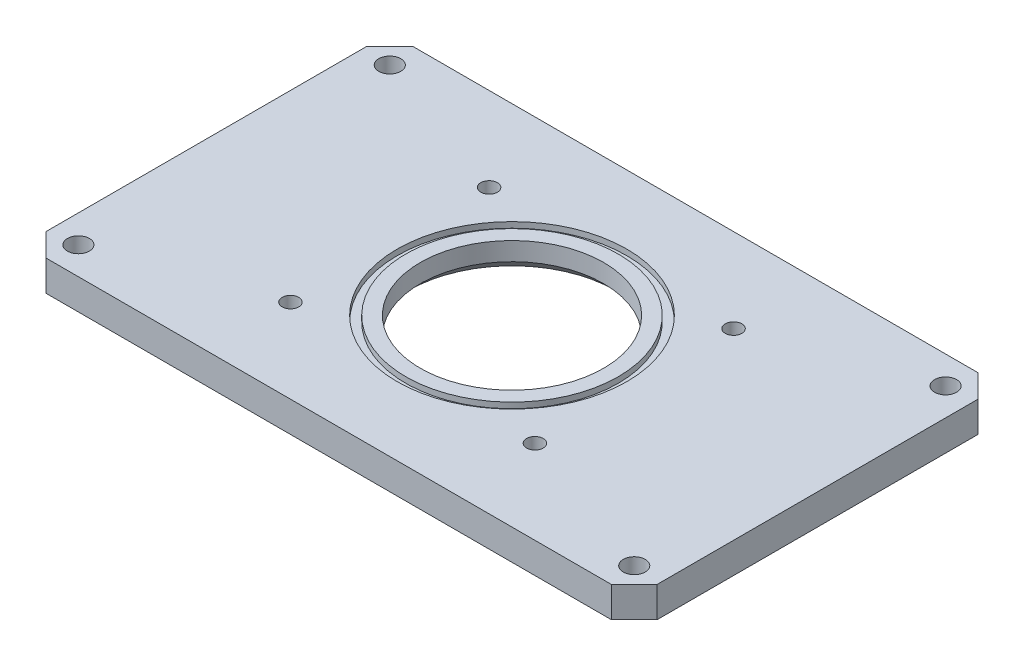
ISO-10303-21;
HEADER;
FILE_DESCRIPTION(('STEP AP214'),'2;1');
FILE_NAME('part.step','',(''),(''),'','','');
FILE_SCHEMA(('AUTOMOTIVE_DESIGN { 1 0 10303 214 1 1 1 1 }'));
ENDSEC;
DATA;
#1=APPLICATION_CONTEXT('core data for automotive mechanical design processes');
#2=APPLICATION_PROTOCOL_DEFINITION('international standard','automotive_design',2000,#1);
#3=PRODUCT_CONTEXT('',#1,'mechanical');
#4=PRODUCT('Part','Part','',(#3));
#5=PRODUCT_RELATED_PRODUCT_CATEGORY('part','',(#4));
#6=PRODUCT_DEFINITION_FORMATION('','',#4);
#7=PRODUCT_DEFINITION_CONTEXT('part definition',#1,'design');
#8=PRODUCT_DEFINITION('design','',#6,#7);
#9=PRODUCT_DEFINITION_SHAPE('','',#8);
#10=(LENGTH_UNIT() NAMED_UNIT(*) SI_UNIT(.MILLI.,.METRE.));
#11=(NAMED_UNIT(*) PLANE_ANGLE_UNIT() SI_UNIT($,.RADIAN.));
#12=(NAMED_UNIT(*) SI_UNIT($,.STERADIAN.) SOLID_ANGLE_UNIT());
#13=UNCERTAINTY_MEASURE_WITH_UNIT(LENGTH_MEASURE(1.E-05),#10,'distance_accuracy_value','');
#14=(GEOMETRIC_REPRESENTATION_CONTEXT(3) GLOBAL_UNCERTAINTY_ASSIGNED_CONTEXT((#13)) GLOBAL_UNIT_ASSIGNED_CONTEXT((#10,
#11,#12)) REPRESENTATION_CONTEXT('',''));
#15=CARTESIAN_POINT('',(0.,0.,0.));
#16=DIRECTION('',(0.,0.,1.));
#17=DIRECTION('',(1.,0.,0.));
#18=AXIS2_PLACEMENT_3D('',#15,#16,#17);
#19=CARTESIAN_POINT('',(0.,3.175,0.));
#20=DIRECTION('',(0.,-1.,0.));
#21=DIRECTION('',(0.,0.,-1.));
#22=AXIS2_PLACEMENT_3D('',#19,#20,#21);
#23=PLANE('',#22);
#24=CARTESIAN_POINT('',(0.,3.17500000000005,0.));
#25=DIRECTION('',(0.,-1.,0.));
#26=DIRECTION('',(1.,0.,0.));
#27=AXIS2_PLACEMENT_3D('',#24,#25,#26);
#28=CIRCLE('',#27,22.0853);
#29=CARTESIAN_POINT('',(22.0853,3.175,0.));
#30=VERTEX_POINT('',#29);
#31=EDGE_CURVE('E129',#30,#30,#28,.T.);
#32=ORIENTED_EDGE('',*,*,#31,.F.);
#33=EDGE_LOOP('',(#32));
#34=FACE_BOUND('',#33,.T.);
#35=CARTESIAN_POINT('',(0.,3.175,0.));
#36=DIRECTION('',(0.,-1.,0.));
#37=DIRECTION('',(0.,0.,-1.));
#38=AXIS2_PLACEMENT_3D('',#35,#36,#37);
#39=CIRCLE('',#38,19.05);
#40=CARTESIAN_POINT('',(0.,3.175,-19.05));
#41=VERTEX_POINT('',#40);
#42=EDGE_CURVE('E147',#41,#41,#39,.T.);
#43=ORIENTED_EDGE('',*,*,#42,.T.);
#44=EDGE_LOOP('',(#43));
#45=FACE_BOUND('',#44,.T.);
#46=ADVANCED_FACE('F34',(#34,#45),#23,.F.);
#47=CARTESIAN_POINT('',(63.5,3.175,38.1));
#48=DIRECTION('',(-1.,0.,0.));
#49=DIRECTION('',(0.,0.,1.));
#50=AXIS2_PLACEMENT_3D('',#47,#48,#49);
#51=PLANE('',#50);
#52=DIRECTION('',(0.,0.,-1.));
#53=VECTOR('',#52,1.);
#54=CARTESIAN_POINT('',(63.5,-3.175,38.1));
#55=LINE('',#54,#53);
#56=CARTESIAN_POINT('',(63.5,-3.175,33.3375));
#57=VERTEX_POINT('',#56);
#58=CARTESIAN_POINT('',(63.5,-3.175,-33.3375));
#59=VERTEX_POINT('',#58);
#60=EDGE_CURVE('E174',#57,#59,#55,.T.);
#61=ORIENTED_EDGE('',*,*,#60,.T.);
#62=DIRECTION('',(0.,1.,0.));
#63=VECTOR('',#62,1.);
#64=CARTESIAN_POINT('',(63.5,3.175,-33.3375));
#65=LINE('',#64,#63);
#66=CARTESIAN_POINT('',(63.5,3.175,-33.3375));
#67=VERTEX_POINT('',#66);
#68=EDGE_CURVE('E223',#59,#67,#65,.T.);
#69=ORIENTED_EDGE('',*,*,#68,.T.);
#70=DIRECTION('',(0.,0.,-1.));
#71=VECTOR('',#70,1.);
#72=CARTESIAN_POINT('',(63.5,3.175,38.1));
#73=LINE('',#72,#71);
#74=CARTESIAN_POINT('',(63.5,3.175,33.3375));
#75=VERTEX_POINT('',#74);
#76=EDGE_CURVE('E175',#75,#67,#73,.T.);
#77=ORIENTED_EDGE('',*,*,#76,.F.);
#78=DIRECTION('',(0.,-1.,0.));
#79=VECTOR('',#78,1.);
#80=CARTESIAN_POINT('',(63.5,3.175,33.3375));
#81=LINE('',#80,#79);
#82=EDGE_CURVE('E220',#75,#57,#81,.T.);
#83=ORIENTED_EDGE('',*,*,#82,.T.);
#84=EDGE_LOOP('',(#61,#69,#77,#83));
#85=FACE_BOUND('',#84,.T.);
#86=ADVANCED_FACE('F248',(#85),#51,.F.);
#87=CARTESIAN_POINT('',(-63.5,3.175,-38.1));
#88=DIRECTION('',(0.,0.,1.));
#89=DIRECTION('',(1.,0.,0.));
#90=AXIS2_PLACEMENT_3D('',#87,#88,#89);
#91=PLANE('',#90);
#92=DIRECTION('',(-1.,0.,0.));
#93=VECTOR('',#92,1.);
#94=CARTESIAN_POINT('',(-63.5,-3.175,-38.1));
#95=LINE('',#94,#93);
#96=CARTESIAN_POINT('',(58.7375,-3.175,-38.1));
#97=VERTEX_POINT('',#96);
#98=CARTESIAN_POINT('',(-58.7375,-3.175,-38.1));
#99=VERTEX_POINT('',#98);
#100=EDGE_CURVE('E189',#97,#99,#95,.T.);
#101=ORIENTED_EDGE('',*,*,#100,.T.);
#102=DIRECTION('',(0.,1.,0.));
#103=VECTOR('',#102,1.);
#104=CARTESIAN_POINT('',(-58.7375,3.175,-38.1));
#105=LINE('',#104,#103);
#106=CARTESIAN_POINT('',(-58.7375,3.175,-38.1));
#107=VERTEX_POINT('',#106);
#108=EDGE_CURVE('E211',#99,#107,#105,.T.);
#109=ORIENTED_EDGE('',*,*,#108,.T.);
#110=DIRECTION('',(-1.,0.,0.));
#111=VECTOR('',#110,1.);
#112=CARTESIAN_POINT('',(-63.5,3.175,-38.1));
#113=LINE('',#112,#111);
#114=CARTESIAN_POINT('',(58.7375,3.175,-38.1));
#115=VERTEX_POINT('',#114);
#116=EDGE_CURVE('E178',#115,#107,#113,.T.);
#117=ORIENTED_EDGE('',*,*,#116,.F.);
#118=DIRECTION('',(0.,-1.,0.));
#119=VECTOR('',#118,1.);
#120=CARTESIAN_POINT('',(58.7375,3.175,-38.1));
#121=LINE('',#120,#119);
#122=EDGE_CURVE('E208',#115,#97,#121,.T.);
#123=ORIENTED_EDGE('',*,*,#122,.T.);
#124=EDGE_LOOP('',(#101,#109,#117,#123));
#125=FACE_BOUND('',#124,.T.);
#126=ADVANCED_FACE('F255',(#125),#91,.F.);
#127=CARTESIAN_POINT('',(-63.5,3.175,38.1));
#128=DIRECTION('',(1.,0.,0.));
#129=DIRECTION('',(0.,0.,-1.));
#130=AXIS2_PLACEMENT_3D('',#127,#128,#129);
#131=PLANE('',#130);
#132=DIRECTION('',(0.,0.,1.));
#133=VECTOR('',#132,1.);
#134=CARTESIAN_POINT('',(-63.5,3.175,38.1));
#135=LINE('',#134,#133);
#136=CARTESIAN_POINT('',(-63.5,3.175,-33.3375));
#137=VERTEX_POINT('',#136);
#138=CARTESIAN_POINT('',(-63.5,3.175,33.3375));
#139=VERTEX_POINT('',#138);
#140=EDGE_CURVE('E182',#137,#139,#135,.T.);
#141=ORIENTED_EDGE('',*,*,#140,.F.);
#142=DIRECTION('',(0.,-1.,0.));
#143=VECTOR('',#142,1.);
#144=CARTESIAN_POINT('',(-63.5,3.175,-33.3375));
#145=LINE('',#144,#143);
#146=CARTESIAN_POINT('',(-63.5,-3.175,-33.3375));
#147=VERTEX_POINT('',#146);
#148=EDGE_CURVE('E197',#137,#147,#145,.T.);
#149=ORIENTED_EDGE('',*,*,#148,.T.);
#150=DIRECTION('',(0.,0.,1.));
#151=VECTOR('',#150,1.);
#152=CARTESIAN_POINT('',(-63.5,-3.175,38.1));
#153=LINE('',#152,#151);
#154=CARTESIAN_POINT('',(-63.5,-3.175,33.3375));
#155=VERTEX_POINT('',#154);
#156=EDGE_CURVE('E192',#147,#155,#153,.T.);
#157=ORIENTED_EDGE('',*,*,#156,.T.);
#158=DIRECTION('',(0.,1.,0.));
#159=VECTOR('',#158,1.);
#160=CARTESIAN_POINT('',(-63.5,3.175,33.3375));
#161=LINE('',#160,#159);
#162=EDGE_CURVE('E186',#155,#139,#161,.T.);
#163=ORIENTED_EDGE('',*,*,#162,.T.);
#164=EDGE_LOOP('',(#141,#149,#157,#163));
#165=FACE_BOUND('',#164,.T.);
#166=ADVANCED_FACE('F272',(#165),#131,.F.);
#167=CARTESIAN_POINT('',(-63.5,3.175,38.1));
#168=DIRECTION('',(0.,0.,-1.));
#169=DIRECTION('',(-1.,0.,0.));
#170=AXIS2_PLACEMENT_3D('',#167,#168,#169);
#171=PLANE('',#170);
#172=DIRECTION('',(1.,0.,0.));
#173=VECTOR('',#172,1.);
#174=CARTESIAN_POINT('',(-63.5,-3.175,38.1));
#175=LINE('',#174,#173);
#176=CARTESIAN_POINT('',(-58.7375,-3.175,38.1));
#177=VERTEX_POINT('',#176);
#178=CARTESIAN_POINT('',(58.7375,-3.175,38.1));
#179=VERTEX_POINT('',#178);
#180=EDGE_CURVE('E179',#177,#179,#175,.T.);
#181=ORIENTED_EDGE('',*,*,#180,.T.);
#182=DIRECTION('',(0.,1.,0.));
#183=VECTOR('',#182,1.);
#184=CARTESIAN_POINT('',(58.7375,3.175,38.1));
#185=LINE('',#184,#183);
#186=CARTESIAN_POINT('',(58.7375,3.175,38.1));
#187=VERTEX_POINT('',#186);
#188=EDGE_CURVE('E50',#179,#187,#185,.T.);
#189=ORIENTED_EDGE('',*,*,#188,.T.);
#190=DIRECTION('',(1.,0.,0.));
#191=VECTOR('',#190,1.);
#192=CARTESIAN_POINT('',(-63.5,3.175,38.1));
#193=LINE('',#192,#191);
#194=CARTESIAN_POINT('',(-58.7375,3.175,38.1));
#195=VERTEX_POINT('',#194);
#196=EDGE_CURVE('E184',#195,#187,#193,.T.);
#197=ORIENTED_EDGE('',*,*,#196,.F.);
#198=DIRECTION('',(0.,-1.,0.));
#199=VECTOR('',#198,1.);
#200=CARTESIAN_POINT('',(-58.7375,3.175,38.1));
#201=LINE('',#200,#199);
#202=EDGE_CURVE('E225',#195,#177,#201,.T.);
#203=ORIENTED_EDGE('',*,*,#202,.T.);
#204=EDGE_LOOP('',(#181,#189,#197,#203));
#205=FACE_BOUND('',#204,.T.);
#206=ADVANCED_FACE('F264',(#205),#171,.F.);
#207=CARTESIAN_POINT('',(0.,3.17500000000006,0.));
#208=DIRECTION('',(0.,-1.,0.));
#209=DIRECTION('',(1.,0.,0.));
#210=AXIS2_PLACEMENT_3D('',#207,#208,#209);
#211=CIRCLE('',#210,23.8633);
#212=CARTESIAN_POINT('',(23.8633,3.17500000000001,0.));
#213=VERTEX_POINT('',#212);
#214=EDGE_CURVE('E277',#213,#213,#211,.T.);
#215=ORIENTED_EDGE('',*,*,#214,.T.);
#216=EDGE_LOOP('',(#215));
#217=FACE_BOUND('',#216,.T.);
#218=CARTESIAN_POINT('',(-25.4,3.175,-20.6375));
#219=DIRECTION('',(0.,1.,0.));
#220=DIRECTION('',(0.,0.,1.));
#221=AXIS2_PLACEMENT_3D('',#218,#219,#220);
#222=CIRCLE('',#221,1.72719999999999);
#223=CARTESIAN_POINT('',(-25.4,3.175,-18.9103));
#224=VERTEX_POINT('',#223);
#225=EDGE_CURVE('E123',#224,#224,#222,.T.);
#226=ORIENTED_EDGE('',*,*,#225,.F.);
#227=EDGE_LOOP('',(#226));
#228=FACE_BOUND('',#227,.T.);
#229=CARTESIAN_POINT('',(25.4,3.175,-20.6375));
#230=DIRECTION('',(0.,1.,0.));
#231=DIRECTION('',(0.,0.,1.));
#232=AXIS2_PLACEMENT_3D('',#229,#230,#231);
#233=CIRCLE('',#232,1.72719999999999);
#234=CARTESIAN_POINT('',(25.4,3.175,-18.9103));
#235=VERTEX_POINT('',#234);
#236=EDGE_CURVE('E122',#235,#235,#233,.T.);
#237=ORIENTED_EDGE('',*,*,#236,.F.);
#238=EDGE_LOOP('',(#237));
#239=FACE_BOUND('',#238,.T.);
#240=CARTESIAN_POINT('',(25.4,3.175,20.6375));
#241=DIRECTION('',(0.,1.,0.));
#242=DIRECTION('',(0.,0.,1.));
#243=AXIS2_PLACEMENT_3D('',#240,#241,#242);
#244=CIRCLE('',#243,1.72719999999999);
#245=CARTESIAN_POINT('',(25.4,3.175,22.3647));
#246=VERTEX_POINT('',#245);
#247=EDGE_CURVE('E135',#246,#246,#244,.T.);
#248=ORIENTED_EDGE('',*,*,#247,.F.);
#249=EDGE_LOOP('',(#248));
#250=FACE_BOUND('',#249,.T.);
#251=CARTESIAN_POINT('',(-25.4,3.175,20.6375));
#252=DIRECTION('',(0.,1.,0.));
#253=DIRECTION('',(0.,0.,1.));
#254=AXIS2_PLACEMENT_3D('',#251,#252,#253);
#255=CIRCLE('',#254,1.72719999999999);
#256=CARTESIAN_POINT('',(-25.4,3.175,22.3647));
#257=VERTEX_POINT('',#256);
#258=EDGE_CURVE('E141',#257,#257,#255,.T.);
#259=ORIENTED_EDGE('',*,*,#258,.F.);
#260=EDGE_LOOP('',(#259));
#261=FACE_BOUND('',#260,.T.);
#262=CARTESIAN_POINT('',(-57.7511539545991,3.175,32.3511539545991));
#263=DIRECTION('',(0.,-1.,0.));
#264=DIRECTION('',(0.,0.,-1.));
#265=AXIS2_PLACEMENT_3D('',#262,#263,#264);
#266=CIRCLE('',#265,2.28599999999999);
#267=CARTESIAN_POINT('',(-57.7511539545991,3.175,30.0651539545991));
#268=VERTEX_POINT('',#267);
#269=EDGE_CURVE('E153',#268,#268,#266,.F.);
#270=ORIENTED_EDGE('',*,*,#269,.F.);
#271=EDGE_LOOP('',(#270));
#272=FACE_BOUND('',#271,.T.);
#273=CARTESIAN_POINT('',(57.7511539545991,3.175,32.3511539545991));
#274=DIRECTION('',(0.,-1.,0.));
#275=DIRECTION('',(0.,0.,-1.));
#276=AXIS2_PLACEMENT_3D('',#273,#274,#275);
#277=CIRCLE('',#276,2.28599999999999);
#278=CARTESIAN_POINT('',(57.7511539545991,3.175,30.0651539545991));
#279=VERTEX_POINT('',#278);
#280=EDGE_CURVE('E159',#279,#279,#277,.T.);
#281=ORIENTED_EDGE('',*,*,#280,.T.);
#282=EDGE_LOOP('',(#281));
#283=FACE_BOUND('',#282,.T.);
#284=CARTESIAN_POINT('',(57.7511539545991,3.175,-32.3511539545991));
#285=DIRECTION('',(0.,-1.,0.));
#286=DIRECTION('',(0.,0.,-1.));
#287=AXIS2_PLACEMENT_3D('',#284,#285,#286);
#288=CIRCLE('',#287,2.28599999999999);
#289=CARTESIAN_POINT('',(57.7511539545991,3.175,-34.6371539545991));
#290=VERTEX_POINT('',#289);
#291=EDGE_CURVE('E165',#290,#290,#288,.F.);
#292=ORIENTED_EDGE('',*,*,#291,.F.);
#293=EDGE_LOOP('',(#292));
#294=FACE_BOUND('',#293,.T.);
#295=CARTESIAN_POINT('',(-57.7511539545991,3.175,-32.3511539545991));
#296=DIRECTION('',(0.,-1.,0.));
#297=DIRECTION('',(0.,0.,-1.));
#298=AXIS2_PLACEMENT_3D('',#295,#296,#297);
#299=CIRCLE('',#298,2.28599999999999);
#300=CARTESIAN_POINT('',(-57.7511539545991,3.175,-34.6371539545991));
#301=VERTEX_POINT('',#300);
#302=EDGE_CURVE('E171',#301,#301,#299,.T.);
#303=ORIENTED_EDGE('',*,*,#302,.T.);
#304=EDGE_LOOP('',(#303));
#305=FACE_BOUND('',#304,.T.);
#306=ORIENTED_EDGE('',*,*,#116,.T.);
#307=DIRECTION('',(0.707106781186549,0.,-0.707106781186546));
#308=VECTOR('',#307,1.);
#309=CARTESIAN_POINT('',(-63.5,3.175,-33.3375));
#310=LINE('',#309,#308);
#311=EDGE_CURVE('E218',#107,#137,#310,.F.);
#312=ORIENTED_EDGE('',*,*,#311,.T.);
#313=ORIENTED_EDGE('',*,*,#140,.T.);
#314=DIRECTION('',(-0.707106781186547,0.,-0.707106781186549));
#315=VECTOR('',#314,1.);
#316=CARTESIAN_POINT('',(-58.7375,3.175,38.1));
#317=LINE('',#316,#315);
#318=EDGE_CURVE('E57',#139,#195,#317,.F.);
#319=ORIENTED_EDGE('',*,*,#318,.T.);
#320=ORIENTED_EDGE('',*,*,#196,.T.);
#321=DIRECTION('',(-0.707106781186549,0.,0.707106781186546));
#322=VECTOR('',#321,1.);
#323=CARTESIAN_POINT('',(63.5,3.175,33.3375));
#324=LINE('',#323,#322);
#325=EDGE_CURVE('E214',#187,#75,#324,.F.);
#326=ORIENTED_EDGE('',*,*,#325,.T.);
#327=ORIENTED_EDGE('',*,*,#76,.T.);
#328=DIRECTION('',(0.707106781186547,0.,0.707106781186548));
#329=VECTOR('',#328,1.);
#330=CARTESIAN_POINT('',(58.7375,3.175,-38.1));
#331=LINE('',#330,#329);
#332=EDGE_CURVE('E216',#67,#115,#331,.F.);
#333=ORIENTED_EDGE('',*,*,#332,.T.);
#334=EDGE_LOOP('',(#306,#312,#313,#319,#320,#326,#327,#333));
#335=FACE_BOUND('',#334,.T.);
#336=ADVANCED_FACE('F251',(#217,#228,#239,#250,#261,#272,#283,#294,#305,#335),#23,.F.);
#337=CARTESIAN_POINT('',(0.,-3.175,0.));
#338=DIRECTION('',(0.,-1.,0.));
#339=DIRECTION('',(0.,0.,-1.));
#340=AXIS2_PLACEMENT_3D('',#337,#338,#339);
#341=PLANE('',#340);
#342=CARTESIAN_POINT('',(0.,-3.175,0.));
#343=DIRECTION('',(0.,-1.,0.));
#344=DIRECTION('',(0.,0.,-1.));
#345=AXIS2_PLACEMENT_3D('',#342,#343,#344);
#346=CIRCLE('',#345,21.59);
#347=CARTESIAN_POINT('',(0.,-3.175,-21.59));
#348=VERTEX_POINT('',#347);
#349=EDGE_CURVE('E11',#348,#348,#346,.F.);
#350=ORIENTED_EDGE('',*,*,#349,.T.);
#351=EDGE_LOOP('',(#350));
#352=FACE_BOUND('',#351,.T.);
#353=CARTESIAN_POINT('',(-57.7511539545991,-3.175,32.3511539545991));
#354=DIRECTION('',(0.,-1.,0.));
#355=DIRECTION('',(0.,0.,-1.));
#356=AXIS2_PLACEMENT_3D('',#353,#354,#355);
#357=CIRCLE('',#356,2.28599999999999);
#358=CARTESIAN_POINT('',(-57.7511539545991,-3.175,30.0651539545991));
#359=VERTEX_POINT('',#358);
#360=EDGE_CURVE('E150',#359,#359,#357,.T.);
#361=ORIENTED_EDGE('',*,*,#360,.F.);
#362=EDGE_LOOP('',(#361));
#363=FACE_BOUND('',#362,.T.);
#364=CARTESIAN_POINT('',(57.7511539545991,-3.175,32.3511539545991));
#365=DIRECTION('',(0.,1.,0.));
#366=DIRECTION('',(0.,0.,-1.));
#367=AXIS2_PLACEMENT_3D('',#364,#365,#366);
#368=CIRCLE('',#367,2.28599999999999);
#369=CARTESIAN_POINT('',(57.7511539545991,-3.175,30.0651539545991));
#370=VERTEX_POINT('',#369);
#371=EDGE_CURVE('E156',#370,#370,#368,.T.);
#372=ORIENTED_EDGE('',*,*,#371,.T.);
#373=EDGE_LOOP('',(#372));
#374=FACE_BOUND('',#373,.T.);
#375=CARTESIAN_POINT('',(57.7511539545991,-3.175,-32.3511539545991));
#376=DIRECTION('',(0.,-1.,0.));
#377=DIRECTION('',(0.,0.,1.));
#378=AXIS2_PLACEMENT_3D('',#375,#376,#377);
#379=CIRCLE('',#378,2.28599999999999);
#380=CARTESIAN_POINT('',(57.7511539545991,-3.175,-30.0651539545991));
#381=VERTEX_POINT('',#380);
#382=EDGE_CURVE('E162',#381,#381,#379,.T.);
#383=ORIENTED_EDGE('',*,*,#382,.F.);
#384=EDGE_LOOP('',(#383));
#385=FACE_BOUND('',#384,.T.);
#386=CARTESIAN_POINT('',(-57.7511539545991,-3.175,-32.3511539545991));
#387=DIRECTION('',(0.,1.,0.));
#388=DIRECTION('',(0.,0.,1.));
#389=AXIS2_PLACEMENT_3D('',#386,#387,#388);
#390=CIRCLE('',#389,2.28599999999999);
#391=CARTESIAN_POINT('',(-57.7511539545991,-3.175,-30.0651539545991));
#392=VERTEX_POINT('',#391);
#393=EDGE_CURVE('E168',#392,#392,#390,.T.);
#394=ORIENTED_EDGE('',*,*,#393,.T.);
#395=EDGE_LOOP('',(#394));
#396=FACE_BOUND('',#395,.T.);
#397=ORIENTED_EDGE('',*,*,#156,.F.);
#398=DIRECTION('',(-0.707106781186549,0.,0.707106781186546));
#399=VECTOR('',#398,1.);
#400=CARTESIAN_POINT('',(-48.4187499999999,-3.175,-48.4187500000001));
#401=LINE('',#400,#399);
#402=EDGE_CURVE('E206',#147,#99,#401,.F.);
#403=ORIENTED_EDGE('',*,*,#402,.T.);
#404=ORIENTED_EDGE('',*,*,#100,.F.);
#405=DIRECTION('',(-0.707106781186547,0.,-0.707106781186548));
#406=VECTOR('',#405,1.);
#407=CARTESIAN_POINT('',(48.41875,-3.175,-48.41875));
#408=LINE('',#407,#406);
#409=EDGE_CURVE('E204',#97,#59,#408,.F.);
#410=ORIENTED_EDGE('',*,*,#409,.T.);
#411=ORIENTED_EDGE('',*,*,#60,.F.);
#412=DIRECTION('',(0.707106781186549,0.,-0.707106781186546));
#413=VECTOR('',#412,1.);
#414=CARTESIAN_POINT('',(48.4187499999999,-3.175,48.4187500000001));
#415=LINE('',#414,#413);
#416=EDGE_CURVE('E202',#57,#179,#415,.F.);
#417=ORIENTED_EDGE('',*,*,#416,.T.);
#418=ORIENTED_EDGE('',*,*,#180,.F.);
#419=DIRECTION('',(0.707106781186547,0.,0.707106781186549));
#420=VECTOR('',#419,1.);
#421=CARTESIAN_POINT('',(-48.4187500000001,-3.175,48.4187499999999));
#422=LINE('',#421,#420);
#423=EDGE_CURVE('E200',#177,#155,#422,.F.);
#424=ORIENTED_EDGE('',*,*,#423,.T.);
#425=EDGE_LOOP('',(#397,#403,#404,#410,#411,#417,#418,#424));
#426=FACE_BOUND('',#425,.T.);
#427=ADVANCED_FACE('F263',(#352,#363,#374,#385,#396,#426),#341,.T.);
#428=CARTESIAN_POINT('',(-63.5,3.175,-33.3375));
#429=DIRECTION('',(0.707106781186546,0.,0.707106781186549));
#430=DIRECTION('',(0.,-1.,0.));
#431=AXIS2_PLACEMENT_3D('',#428,#429,#430);
#432=PLANE('',#431);
#433=ORIENTED_EDGE('',*,*,#311,.F.);
#434=ORIENTED_EDGE('',*,*,#108,.F.);
#435=ORIENTED_EDGE('',*,*,#402,.F.);
#436=ORIENTED_EDGE('',*,*,#148,.F.);
#437=EDGE_LOOP('',(#433,#434,#435,#436));
#438=FACE_BOUND('',#437,.T.);
#439=ADVANCED_FACE('F270',(#438),#432,.F.);
#440=CARTESIAN_POINT('',(58.7375,3.175,-38.1));
#441=DIRECTION('',(-0.707106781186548,0.,0.707106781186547));
#442=DIRECTION('',(0.,-1.,0.));
#443=AXIS2_PLACEMENT_3D('',#440,#441,#442);
#444=PLANE('',#443);
#445=ORIENTED_EDGE('',*,*,#332,.F.);
#446=ORIENTED_EDGE('',*,*,#68,.F.);
#447=ORIENTED_EDGE('',*,*,#409,.F.);
#448=ORIENTED_EDGE('',*,*,#122,.F.);
#449=EDGE_LOOP('',(#445,#446,#447,#448));
#450=FACE_BOUND('',#449,.T.);
#451=ADVANCED_FACE('F319',(#450),#444,.F.);
#452=CARTESIAN_POINT('',(63.5,3.175,33.3375));
#453=DIRECTION('',(-0.707106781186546,0.,-0.707106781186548));
#454=DIRECTION('',(0.,-1.,0.));
#455=AXIS2_PLACEMENT_3D('',#452,#453,#454);
#456=PLANE('',#455);
#457=ORIENTED_EDGE('',*,*,#325,.F.);
#458=ORIENTED_EDGE('',*,*,#188,.F.);
#459=ORIENTED_EDGE('',*,*,#416,.F.);
#460=ORIENTED_EDGE('',*,*,#82,.F.);
#461=EDGE_LOOP('',(#457,#458,#459,#460));
#462=FACE_BOUND('',#461,.T.);
#463=ADVANCED_FACE('F315',(#462),#456,.F.);
#464=CARTESIAN_POINT('',(-58.7375,3.175,38.1));
#465=DIRECTION('',(0.707106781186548,0.,-0.707106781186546));
#466=DIRECTION('',(0.,-1.,0.));
#467=AXIS2_PLACEMENT_3D('',#464,#465,#466);
#468=PLANE('',#467);
#469=ORIENTED_EDGE('',*,*,#318,.F.);
#470=ORIENTED_EDGE('',*,*,#162,.F.);
#471=ORIENTED_EDGE('',*,*,#423,.F.);
#472=ORIENTED_EDGE('',*,*,#202,.F.);
#473=EDGE_LOOP('',(#469,#470,#471,#472));
#474=FACE_BOUND('',#473,.T.);
#475=ADVANCED_FACE('F310',(#474),#468,.F.);
#476=CARTESIAN_POINT('',(-57.7511539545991,-3.175,-32.3511539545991));
#477=DIRECTION('',(0.,1.,0.));
#478=DIRECTION('',(0.,0.,1.));
#479=AXIS2_PLACEMENT_3D('',#476,#477,#478);
#480=CYLINDRICAL_SURFACE('',#479,2.28599999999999);
#481=ORIENTED_EDGE('',*,*,#393,.F.);
#482=EDGE_LOOP('',(#481));
#483=FACE_BOUND('',#482,.T.);
#484=ORIENTED_EDGE('',*,*,#302,.F.);
#485=EDGE_LOOP('',(#484));
#486=FACE_BOUND('',#485,.T.);
#487=ADVANCED_FACE('F345',(#483,#486),#480,.F.);
#488=CARTESIAN_POINT('',(57.7511539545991,-3.175,-32.3511539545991));
#489=DIRECTION('',(0.,1.,0.));
#490=DIRECTION('',(0.,0.,1.));
#491=AXIS2_PLACEMENT_3D('',#488,#489,#490);
#492=CYLINDRICAL_SURFACE('',#491,2.28599999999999);
#493=ORIENTED_EDGE('',*,*,#382,.T.);
#494=EDGE_LOOP('',(#493));
#495=FACE_BOUND('',#494,.T.);
#496=ORIENTED_EDGE('',*,*,#291,.T.);
#497=EDGE_LOOP('',(#496));
#498=FACE_BOUND('',#497,.T.);
#499=ADVANCED_FACE('F349',(#495,#498),#492,.F.);
#500=CARTESIAN_POINT('',(57.7511539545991,-3.175,32.3511539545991));
#501=DIRECTION('',(0.,1.,0.));
#502=DIRECTION('',(0.,0.,1.));
#503=AXIS2_PLACEMENT_3D('',#500,#501,#502);
#504=CYLINDRICAL_SURFACE('',#503,2.28599999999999);
#505=ORIENTED_EDGE('',*,*,#371,.F.);
#506=EDGE_LOOP('',(#505));
#507=FACE_BOUND('',#506,.T.);
#508=ORIENTED_EDGE('',*,*,#280,.F.);
#509=EDGE_LOOP('',(#508));
#510=FACE_BOUND('',#509,.T.);
#511=ADVANCED_FACE('F354',(#507,#510),#504,.F.);
#512=CARTESIAN_POINT('',(-57.7511539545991,-3.175,32.3511539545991));
#513=DIRECTION('',(0.,1.,0.));
#514=DIRECTION('',(0.,0.,1.));
#515=AXIS2_PLACEMENT_3D('',#512,#513,#514);
#516=CYLINDRICAL_SURFACE('',#515,2.28599999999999);
#517=ORIENTED_EDGE('',*,*,#360,.T.);
#518=EDGE_LOOP('',(#517));
#519=FACE_BOUND('',#518,.T.);
#520=ORIENTED_EDGE('',*,*,#269,.T.);
#521=EDGE_LOOP('',(#520));
#522=FACE_BOUND('',#521,.T.);
#523=ADVANCED_FACE('F244',(#519,#522),#516,.F.);
#524=CARTESIAN_POINT('',(0.,3.175,0.));
#525=DIRECTION('',(0.,-1.,0.));
#526=DIRECTION('',(0.,0.,-1.));
#527=AXIS2_PLACEMENT_3D('',#524,#525,#526);
#528=CYLINDRICAL_SURFACE('',#527,19.05);
#529=CARTESIAN_POINT('',(0.,-0.635000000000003,0.));
#530=DIRECTION('',(0.,-1.,0.));
#531=DIRECTION('',(0.,0.,-1.));
#532=AXIS2_PLACEMENT_3D('',#529,#530,#531);
#533=CIRCLE('',#532,19.05);
#534=CARTESIAN_POINT('',(0.,-0.635000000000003,-19.05));
#535=VERTEX_POINT('',#534);
#536=EDGE_CURVE('E43',#535,#535,#533,.T.);
#537=ORIENTED_EDGE('',*,*,#536,.T.);
#538=EDGE_LOOP('',(#537));
#539=FACE_BOUND('',#538,.T.);
#540=ORIENTED_EDGE('',*,*,#42,.F.);
#541=EDGE_LOOP('',(#540));
#542=FACE_BOUND('',#541,.T.);
#543=ADVANCED_FACE('F231',(#539,#542),#528,.F.);
#544=CARTESIAN_POINT('',(0.,-0.635000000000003,0.));
#545=DIRECTION('',(0.,-1.,0.));
#546=DIRECTION('',(0.,0.,-1.));
#547=AXIS2_PLACEMENT_3D('',#544,#545,#546);
#548=CONICAL_SURFACE('',#547,19.05,0.785398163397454);
#549=ORIENTED_EDGE('',*,*,#349,.F.);
#550=EDGE_LOOP('',(#549));
#551=FACE_BOUND('',#550,.T.);
#552=ORIENTED_EDGE('',*,*,#536,.F.);
#553=EDGE_LOOP('',(#552));
#554=FACE_BOUND('',#553,.T.);
#555=ADVANCED_FACE('F37',(#551,#554),#548,.F.);
#556=CARTESIAN_POINT('',(-25.4,-0.634999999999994,20.6375));
#557=DIRECTION('',(0.,1.,0.));
#558=DIRECTION('',(0.,0.,1.));
#559=AXIS2_PLACEMENT_3D('',#556,#557,#558);
#560=CONICAL_SURFACE('',#559,1.72719999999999,1.02974425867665);
#561=CARTESIAN_POINT('',(-25.4,-1.67280646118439,20.6375));
#562=VERTEX_POINT('',#561);
#563=VERTEX_LOOP('',#562);
#564=FACE_BOUND('',#563,.T.);
#565=CARTESIAN_POINT('',(-25.4,-0.634999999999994,20.6375));
#566=DIRECTION('',(0.,1.,0.));
#567=DIRECTION('',(0.,0.,1.));
#568=AXIS2_PLACEMENT_3D('',#565,#566,#567);
#569=CIRCLE('',#568,1.72719999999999);
#570=CARTESIAN_POINT('',(-25.4,-0.634999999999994,22.3647));
#571=VERTEX_POINT('',#570);
#572=EDGE_CURVE('E144',#571,#571,#569,.T.);
#573=ORIENTED_EDGE('',*,*,#572,.T.);
#574=EDGE_LOOP('',(#573));
#575=FACE_BOUND('',#574,.T.);
#576=ADVANCED_FACE('F235',(#564,#575),#560,.F.);
#577=CARTESIAN_POINT('',(-25.4,3.175,20.6375));
#578=DIRECTION('',(0.,1.,0.));
#579=DIRECTION('',(0.,0.,1.));
#580=AXIS2_PLACEMENT_3D('',#577,#578,#579);
#581=CYLINDRICAL_SURFACE('',#580,1.72719999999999);
#582=ORIENTED_EDGE('',*,*,#572,.F.);
#583=EDGE_LOOP('',(#582));
#584=FACE_BOUND('',#583,.T.);
#585=ORIENTED_EDGE('',*,*,#258,.T.);
#586=EDGE_LOOP('',(#585));
#587=FACE_BOUND('',#586,.T.);
#588=ADVANCED_FACE('F241',(#584,#587),#581,.F.);
#589=CARTESIAN_POINT('',(25.4,-0.634999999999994,20.6375));
#590=DIRECTION('',(0.,1.,0.));
#591=DIRECTION('',(0.,0.,1.));
#592=AXIS2_PLACEMENT_3D('',#589,#590,#591);
#593=CONICAL_SURFACE('',#592,1.72719999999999,1.02974425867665);
#594=CARTESIAN_POINT('',(25.4,-1.67280646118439,20.6375));
#595=VERTEX_POINT('',#594);
#596=VERTEX_LOOP('',#595);
#597=FACE_BOUND('',#596,.T.);
#598=CARTESIAN_POINT('',(25.4,-0.634999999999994,20.6375));
#599=DIRECTION('',(0.,1.,0.));
#600=DIRECTION('',(0.,0.,1.));
#601=AXIS2_PLACEMENT_3D('',#598,#599,#600);
#602=CIRCLE('',#601,1.72719999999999);
#603=CARTESIAN_POINT('',(25.4,-0.634999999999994,22.3647));
#604=VERTEX_POINT('',#603);
#605=EDGE_CURVE('E138',#604,#604,#602,.T.);
#606=ORIENTED_EDGE('',*,*,#605,.T.);
#607=EDGE_LOOP('',(#606));
#608=FACE_BOUND('',#607,.T.);
#609=ADVANCED_FACE('F368',(#597,#608),#593,.F.);
#610=CARTESIAN_POINT('',(25.4,3.175,20.6375));
#611=DIRECTION('',(0.,1.,0.));
#612=DIRECTION('',(0.,0.,1.));
#613=AXIS2_PLACEMENT_3D('',#610,#611,#612);
#614=CYLINDRICAL_SURFACE('',#613,1.72719999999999);
#615=ORIENTED_EDGE('',*,*,#605,.F.);
#616=EDGE_LOOP('',(#615));
#617=FACE_BOUND('',#616,.T.);
#618=ORIENTED_EDGE('',*,*,#247,.T.);
#619=EDGE_LOOP('',(#618));
#620=FACE_BOUND('',#619,.T.);
#621=ADVANCED_FACE('F372',(#617,#620),#614,.F.);
#622=CARTESIAN_POINT('',(25.4,-0.634999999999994,-20.6375));
#623=DIRECTION('',(0.,1.,0.));
#624=DIRECTION('',(0.,0.,1.));
#625=AXIS2_PLACEMENT_3D('',#622,#623,#624);
#626=CONICAL_SURFACE('',#625,1.72719999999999,1.02974425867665);
#627=CARTESIAN_POINT('',(25.4,-1.67280646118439,-20.6375));
#628=VERTEX_POINT('',#627);
#629=VERTEX_LOOP('',#628);
#630=FACE_BOUND('',#629,.T.);
#631=CARTESIAN_POINT('',(25.4,-0.634999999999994,-20.6375));
#632=DIRECTION('',(0.,1.,0.));
#633=DIRECTION('',(0.,0.,1.));
#634=AXIS2_PLACEMENT_3D('',#631,#632,#633);
#635=CIRCLE('',#634,1.72719999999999);
#636=CARTESIAN_POINT('',(25.4,-0.634999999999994,-18.9103));
#637=VERTEX_POINT('',#636);
#638=EDGE_CURVE('E126',#637,#637,#635,.T.);
#639=ORIENTED_EDGE('',*,*,#638,.T.);
#640=EDGE_LOOP('',(#639));
#641=FACE_BOUND('',#640,.T.);
#642=ADVANCED_FACE('F376',(#630,#641),#626,.F.);
#643=CARTESIAN_POINT('',(25.4,3.175,-20.6375));
#644=DIRECTION('',(0.,1.,0.));
#645=DIRECTION('',(0.,0.,1.));
#646=AXIS2_PLACEMENT_3D('',#643,#644,#645);
#647=CYLINDRICAL_SURFACE('',#646,1.72719999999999);
#648=ORIENTED_EDGE('',*,*,#638,.F.);
#649=EDGE_LOOP('',(#648));
#650=FACE_BOUND('',#649,.T.);
#651=ORIENTED_EDGE('',*,*,#236,.T.);
#652=EDGE_LOOP('',(#651));
#653=FACE_BOUND('',#652,.T.);
#654=ADVANCED_FACE('F116',(#650,#653),#647,.F.);
#655=CARTESIAN_POINT('',(-25.4,-0.634999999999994,-20.6375));
#656=DIRECTION('',(0.,1.,0.));
#657=DIRECTION('',(0.,0.,1.));
#658=AXIS2_PLACEMENT_3D('',#655,#656,#657);
#659=CONICAL_SURFACE('',#658,1.72719999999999,1.02974425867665);
#660=CARTESIAN_POINT('',(-25.4,-1.67280646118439,-20.6375));
#661=VERTEX_POINT('',#660);
#662=VERTEX_LOOP('',#661);
#663=FACE_BOUND('',#662,.T.);
#664=CARTESIAN_POINT('',(-25.4,-0.634999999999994,-20.6375));
#665=DIRECTION('',(0.,1.,0.));
#666=DIRECTION('',(0.,0.,1.));
#667=AXIS2_PLACEMENT_3D('',#664,#665,#666);
#668=CIRCLE('',#667,1.72719999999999);
#669=CARTESIAN_POINT('',(-25.4,-0.634999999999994,-18.9103));
#670=VERTEX_POINT('',#669);
#671=EDGE_CURVE('E120',#670,#670,#668,.T.);
#672=ORIENTED_EDGE('',*,*,#671,.T.);
#673=EDGE_LOOP('',(#672));
#674=FACE_BOUND('',#673,.T.);
#675=ADVANCED_FACE('F112',(#663,#674),#659,.F.);
#676=CARTESIAN_POINT('',(-25.4,3.175,-20.6375));
#677=DIRECTION('',(0.,1.,0.));
#678=DIRECTION('',(0.,0.,1.));
#679=AXIS2_PLACEMENT_3D('',#676,#677,#678);
#680=CYLINDRICAL_SURFACE('',#679,1.72719999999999);
#681=ORIENTED_EDGE('',*,*,#671,.F.);
#682=EDGE_LOOP('',(#681));
#683=FACE_BOUND('',#682,.T.);
#684=ORIENTED_EDGE('',*,*,#225,.T.);
#685=EDGE_LOOP('',(#684));
#686=FACE_BOUND('',#685,.T.);
#687=ADVANCED_FACE('F115',(#683,#686),#680,.F.);
#688=CARTESIAN_POINT('',(0.,0.,0.));
#689=DIRECTION('',(0.,-1.,0.));
#690=DIRECTION('',(1.,0.,0.));
#691=AXIS2_PLACEMENT_3D('',#688,#689,#690);
#692=CYLINDRICAL_SURFACE('',#691,22.0853);
#693=CARTESIAN_POINT('',(0.,1.98437500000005,0.));
#694=DIRECTION('',(0.,-1.,0.));
#695=DIRECTION('',(1.,0.,0.));
#696=AXIS2_PLACEMENT_3D('',#693,#694,#695);
#697=CIRCLE('',#696,22.0853);
#698=CARTESIAN_POINT('',(22.0853,1.98437500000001,0.));
#699=VERTEX_POINT('',#698);
#700=EDGE_CURVE('E403',#699,#699,#697,.T.);
#701=ORIENTED_EDGE('',*,*,#700,.F.);
#702=EDGE_LOOP('',(#701));
#703=FACE_BOUND('',#702,.T.);
#704=ORIENTED_EDGE('',*,*,#31,.T.);
#705=EDGE_LOOP('',(#704));
#706=FACE_BOUND('',#705,.T.);
#707=ADVANCED_FACE('F386',(#703,#706),#692,.T.);
#708=CARTESIAN_POINT('',(22.0853,1.98437500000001,0.));
#709=DIRECTION('',(0.,-1.,0.));
#710=DIRECTION('',(1.,0.,0.));
#711=AXIS2_PLACEMENT_3D('',#708,#709,#710);
#712=PLANE('',#711);
#713=CARTESIAN_POINT('',(0.,1.98437500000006,0.));
#714=DIRECTION('',(0.,-1.,0.));
#715=DIRECTION('',(1.,0.,0.));
#716=AXIS2_PLACEMENT_3D('',#713,#714,#715);
#717=CIRCLE('',#716,23.8633);
#718=CARTESIAN_POINT('',(23.8633,1.98437500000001,0.));
#719=VERTEX_POINT('',#718);
#720=EDGE_CURVE('E402',#719,#719,#717,.T.);
#721=ORIENTED_EDGE('',*,*,#720,.F.);
#722=EDGE_LOOP('',(#721));
#723=FACE_BOUND('',#722,.T.);
#724=ORIENTED_EDGE('',*,*,#700,.T.);
#725=EDGE_LOOP('',(#724));
#726=FACE_BOUND('',#725,.T.);
#727=ADVANCED_FACE('F389',(#723,#726),#712,.F.);
#728=CARTESIAN_POINT('',(0.,0.,0.));
#729=DIRECTION('',(0.,-1.,0.));
#730=DIRECTION('',(1.,0.,0.));
#731=AXIS2_PLACEMENT_3D('',#728,#729,#730);
#732=CYLINDRICAL_SURFACE('',#731,23.8633);
#733=ORIENTED_EDGE('',*,*,#214,.F.);
#734=EDGE_LOOP('',(#733));
#735=FACE_BOUND('',#734,.T.);
#736=ORIENTED_EDGE('',*,*,#720,.T.);
#737=EDGE_LOOP('',(#736));
#738=FACE_BOUND('',#737,.T.);
#739=ADVANCED_FACE('F393',(#735,#738),#732,.F.);
#740=CLOSED_SHELL('',(#46,#86,#126,#166,#206,#336,#427,#439,#451,#463,#475,#487,#499,#511,#523,
#543,#555,#576,#588,#609,#621,#642,#654,#675,#687,#707,#727,#739));
#741=MANIFOLD_SOLID_BREP('B2',#740);
#742=ADVANCED_BREP_SHAPE_REPRESENTATION('',(#18,#741),#14);
#743=SHAPE_DEFINITION_REPRESENTATION(#9,#742);
ENDSEC;
END-ISO-10303-21;
